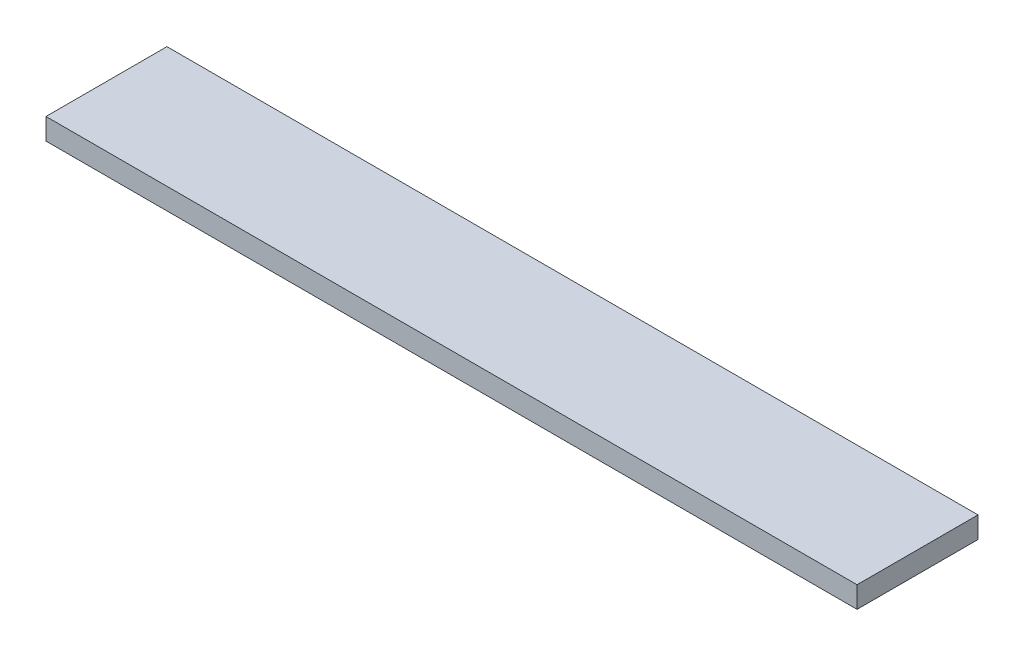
from build123d import *

# Parameters (mm, degrees)
CROQUIS2_W              = 570
CROQUIS2_H              = 85
SALIENTE_EXTRUIR1_DEPTH = 15


with BuildPart() as part:
    # Croquis2 → Saliente-Extruir1 (new body)
    with BuildSketch(Plane(origin=(0, 0, 0), x_dir=(1, 0, 0), z_dir=(0, 1, 0))):
        Rectangle(CROQUIS2_W, CROQUIS2_H)
    extrude(amount=SALIENTE_EXTRUIR1_DEPTH)


solid = part.part
